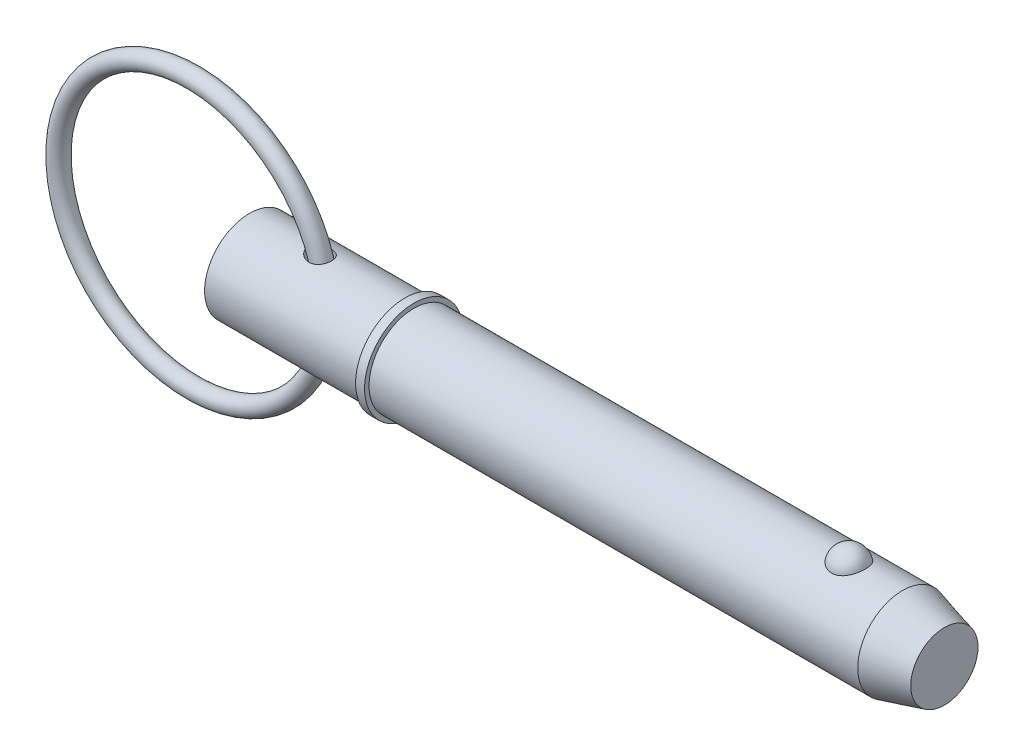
ISO-10303-21;
HEADER;
FILE_DESCRIPTION(('STEP AP214'),'2;1');
FILE_NAME('part.step','',(''),(''),'','','');
FILE_SCHEMA(('AUTOMOTIVE_DESIGN { 1 0 10303 214 1 1 1 1 }'));
ENDSEC;
DATA;
#1=APPLICATION_CONTEXT('core data for automotive mechanical design processes');
#2=APPLICATION_PROTOCOL_DEFINITION('international standard','automotive_design',2000,#1);
#3=PRODUCT_CONTEXT('',#1,'mechanical');
#4=PRODUCT('Part','Part','',(#3));
#5=PRODUCT_RELATED_PRODUCT_CATEGORY('part','',(#4));
#6=PRODUCT_DEFINITION_FORMATION('','',#4);
#7=PRODUCT_DEFINITION_CONTEXT('part definition',#1,'design');
#8=PRODUCT_DEFINITION('design','',#6,#7);
#9=PRODUCT_DEFINITION_SHAPE('','',#8);
#10=(LENGTH_UNIT() NAMED_UNIT(*) SI_UNIT(.MILLI.,.METRE.));
#11=(NAMED_UNIT(*) PLANE_ANGLE_UNIT() SI_UNIT($,.RADIAN.));
#12=(NAMED_UNIT(*) SI_UNIT($,.STERADIAN.) SOLID_ANGLE_UNIT());
#13=UNCERTAINTY_MEASURE_WITH_UNIT(LENGTH_MEASURE(1.E-05),#10,'distance_accuracy_value','');
#14=(GEOMETRIC_REPRESENTATION_CONTEXT(3) GLOBAL_UNCERTAINTY_ASSIGNED_CONTEXT((#13)) GLOBAL_UNIT_ASSIGNED_CONTEXT((#10,
#11,#12)) REPRESENTATION_CONTEXT('',''));
#15=CARTESIAN_POINT('',(0.,0.,0.));
#16=DIRECTION('',(0.,0.,1.));
#17=DIRECTION('',(1.,0.,0.));
#18=AXIS2_PLACEMENT_3D('',#15,#16,#17);
#19=CARTESIAN_POINT('',(-11.9894358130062,0.,0.));
#20=DIRECTION('',(0.,0.,1.));
#21=DIRECTION('',(1.,0.,0.));
#22=AXIS2_PLACEMENT_3D('',#19,#20,#21);
#23=TOROIDAL_SURFACE('',#22,28.575,1.905);
#24=CARTESIAN_POINT('',(18.4905641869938,0.,0.));
#25=VERTEX_POINT('',#24);
#26=VERTEX_LOOP('',#25);
#27=FACE_BOUND('',#26,.T.);
#28=ADVANCED_FACE('P0_F12',(#27),#23,.T.);
#29=CLOSED_SHELL('',(#28));
#30=MANIFOLD_SOLID_BREP('P0_B1',#29);
#31=CARTESIAN_POINT('',(0.,0.,0.));
#32=DIRECTION('',(1.,0.,0.));
#33=DIRECTION('',(0.,0.,-1.));
#34=AXIS2_PLACEMENT_3D('',#31,#32,#33);
#35=CYLINDRICAL_SURFACE('',#34,9.525);
#36=CARTESIAN_POINT('',(12.9513882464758,9.41921920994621,-1.41559473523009));
#37=CARTESIAN_POINT('',(13.0504692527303,9.40163924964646,-1.53256769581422));
#38=CARTESIAN_POINT('',(13.1602600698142,9.38319823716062,-1.64044593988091));
#39=CARTESIAN_POINT('',(13.3966485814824,9.34687220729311,-1.83618480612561));
#40=CARTESIAN_POINT('',(13.5232761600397,9.32898824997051,-1.92400906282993));
#41=CARTESIAN_POINT('',(13.78900694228,9.29593183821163,-2.07784697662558));
#42=CARTESIAN_POINT('',(13.9280753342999,9.28075215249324,-2.14391921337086));
#43=CARTESIAN_POINT('',(14.2153444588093,9.25488828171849,-2.25295850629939));
#44=CARTESIAN_POINT('',(14.3635415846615,9.24420233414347,-2.295934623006));
#45=CARTESIAN_POINT('',(14.669669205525,9.22859713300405,-2.3579005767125));
#46=CARTESIAN_POINT('',(14.8277567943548,9.22385123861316,-2.37617053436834));
#47=CARTESIAN_POINT('',(15.1447573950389,9.22170813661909,-2.38448481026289));
#48=CARTESIAN_POINT('',(15.3036699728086,9.22430739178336,-2.3745427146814));
#49=CARTESIAN_POINT('',(15.6046561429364,9.2363636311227,-2.32717331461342));
#50=CARTESIAN_POINT('',(15.7470893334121,9.24528216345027,-2.29190131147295));
#51=CARTESIAN_POINT('',(16.0228763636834,9.26842607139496,-2.19642882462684));
#52=CARTESIAN_POINT('',(16.1562346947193,9.28264879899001,-2.1362407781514));
#53=CARTESIAN_POINT('',(16.3991522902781,9.31332263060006,-1.99805318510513));
#54=CARTESIAN_POINT('',(16.5097585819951,9.32951023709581,-1.92182839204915));
#55=CARTESIAN_POINT('',(16.7159974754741,9.36298467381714,-1.75147176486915));
#56=CARTESIAN_POINT('',(16.811631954,9.38027136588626,-1.65734217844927));
#57=CARTESIAN_POINT('',(16.9833240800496,9.41356881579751,-1.45618916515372));
#58=CARTESIAN_POINT('',(17.0597719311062,9.42959946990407,-1.34950141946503));
#59=CARTESIAN_POINT('',(17.1939538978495,9.45905380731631,-1.1246201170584));
#60=CARTESIAN_POINT('',(17.2516877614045,9.4724774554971,-1.00642640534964));
#61=CARTESIAN_POINT('',(17.3474400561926,9.49535683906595,-0.760990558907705));
#62=CARTESIAN_POINT('',(17.3853184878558,9.50478431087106,-0.633691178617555));
#63=CARTESIAN_POINT('',(17.4399027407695,9.51852575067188,-0.374363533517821));
#64=CARTESIAN_POINT('',(17.4566077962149,9.52283953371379,-0.242335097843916));
#65=CARTESIAN_POINT('',(17.4685150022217,9.52590431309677,0.0235692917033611));
#66=CARTESIAN_POINT('',(17.4635842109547,9.52462091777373,0.157451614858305));
#67=CARTESIAN_POINT('',(17.4320243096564,9.5165501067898,0.422467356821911));
#68=CARTESIAN_POINT('',(17.4053947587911,9.50976257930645,0.553600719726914));
#69=CARTESIAN_POINT('',(17.3310009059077,9.49140797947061,0.809490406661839));
#70=CARTESIAN_POINT('',(17.2832204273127,9.47983724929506,0.93424176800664));
#71=CARTESIAN_POINT('',(17.1676219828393,9.45318034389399,1.1736825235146));
#72=CARTESIAN_POINT('',(17.0998044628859,9.43809424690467,1.28837214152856));
#73=CARTESIAN_POINT('',(16.9461013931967,9.40614962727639,1.50393386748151));
#74=CARTESIAN_POINT('',(16.8602910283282,9.38929862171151,1.6048606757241));
#75=CARTESIAN_POINT('',(16.6726759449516,9.35566510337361,1.79055313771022));
#76=CARTESIAN_POINT('',(16.5708731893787,9.33888258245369,1.87532077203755));
#77=CARTESIAN_POINT('',(16.3550631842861,9.30741331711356,2.02572386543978));
#78=CARTESIAN_POINT('',(16.2411701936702,9.29270956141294,2.09151983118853));
#79=CARTESIAN_POINT('',(16.0037488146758,9.26681293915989,2.20343355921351));
#80=CARTESIAN_POINT('',(15.8802207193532,9.25561996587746,2.24955191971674));
#81=CARTESIAN_POINT('',(15.6262451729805,9.23779438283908,2.32167613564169));
#82=CARTESIAN_POINT('',(15.4957570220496,9.23119272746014,2.34754561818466));
#83=CARTESIAN_POINT('',(15.2322153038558,9.22318493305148,2.37881082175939));
#84=CARTESIAN_POINT('',(15.0991611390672,9.22178001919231,2.3842017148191));
#85=CARTESIAN_POINT('',(14.8267609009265,9.22414647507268,2.37503099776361));
#86=CARTESIAN_POINT('',(14.6874545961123,9.22819578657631,2.35939810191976));
#87=CARTESIAN_POINT('',(14.412976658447,9.24129253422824,2.30756034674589));
#88=CARTESIAN_POINT('',(14.2778066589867,9.25034191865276,2.27134746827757));
#89=CARTESIAN_POINT('',(14.0027915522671,9.27334688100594,2.17561454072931));
#90=CARTESIAN_POINT('',(13.8635960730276,9.28766658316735,2.11431132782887));
#91=CARTESIAN_POINT('',(13.5969045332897,9.31925368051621,1.97041856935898));
#92=CARTESIAN_POINT('',(13.4694182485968,9.33652350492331,1.88781145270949));
#93=CARTESIAN_POINT('',(13.2243568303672,9.37286659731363,1.69844580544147));
#94=CARTESIAN_POINT('',(13.1075060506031,9.39198626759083,1.5907521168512));
#95=CARTESIAN_POINT('',(12.8957171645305,9.42881110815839,1.35544651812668));
#96=CARTESIAN_POINT('',(12.8007455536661,9.44651841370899,1.22786557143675));
#97=CARTESIAN_POINT('',(12.6580495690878,9.4741137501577,0.98872437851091));
#98=CARTESIAN_POINT('',(12.604453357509,9.4848570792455,0.880756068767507));
#99=CARTESIAN_POINT('',(12.515693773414,9.50295777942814,0.657225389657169));
#100=CARTESIAN_POINT('',(12.4805142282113,9.51031812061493,0.54166978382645));
#101=CARTESIAN_POINT('',(12.4305797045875,9.52083647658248,0.305475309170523));
#102=CARTESIAN_POINT('',(12.4159122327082,9.52397648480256,0.184816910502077));
#103=CARTESIAN_POINT('',(12.408320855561,9.52559626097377,-0.0572308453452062));
#104=CARTESIAN_POINT('',(12.4153963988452,9.52407614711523,-0.178620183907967));
#105=CARTESIAN_POINT('',(12.4495068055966,9.51684301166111,-0.409566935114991));
#106=CARTESIAN_POINT('',(12.4750931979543,9.51143444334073,-0.519353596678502));
#107=CARTESIAN_POINT('',(12.543120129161,9.49733710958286,-0.733285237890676));
#108=CARTESIAN_POINT('',(12.5855568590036,9.4886490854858,-0.837431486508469));
#109=CARTESIAN_POINT('',(12.6780792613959,9.47023833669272,-1.02356028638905));
#110=CARTESIAN_POINT('',(12.7261842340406,9.46084463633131,-1.10657511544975));
#111=CARTESIAN_POINT('',(12.8319313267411,9.44081892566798,-1.26610577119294));
#112=CARTESIAN_POINT('',(12.8895756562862,9.43018662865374,-1.34262008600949));
#113=CARTESIAN_POINT('',(12.9513882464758,9.41921920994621,-1.41559473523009));
#114=B_SPLINE_CURVE_WITH_KNOTS('',3,(#36,#37,#38,#39,#40,#41,#42,#43,#44,#45,#46,#47,#48,#49,
#50,#51,#52,#53,#54,#55,#56,#57,#58,#59,#60,#61,#62,#63,#64,#65,#66,#67,#68,#69,#70,#71,#72,#73,
#74,#75,#76,#77,#78,#79,#80,#81,#82,#83,#84,#85,#86,#87,#88,#89,#90,#91,#92,#93,#94,#95,#96,#97,
#98,#99,#100,#101,#102,#103,#104,#105,#106,#107,#108,#109,#110,#111,#112,#113),.UNSPECIFIED.,
.T.,.F.,(4,2,2,2,2,2,2,2,2,2,2,2,2,2,2,2,2,2,2,2,2,2,2,2,2,2,2,2,2,2,2,2,2,2,2,2,2,2,4),(0.,
0.462524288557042,0.925880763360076,1.3879789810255,1.84989578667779,2.32500103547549,
2.79987752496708,3.23851602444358,3.67693583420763,4.08084875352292,4.48471100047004,
4.87953549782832,5.27436531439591,5.67194282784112,6.0695347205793,6.46957303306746,
6.86961947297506,7.26997240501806,7.67031642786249,8.06901977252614,8.46767421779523,
8.86284969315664,9.25801315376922,9.65581560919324,10.0537118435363,10.4726706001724,
10.8917927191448,11.3481090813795,11.8048030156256,12.2824769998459,12.7594145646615,
13.1209614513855,13.4821903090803,13.8449555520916,14.2077115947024,14.5447865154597,
14.881785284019,15.170268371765,15.4588183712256),.UNSPECIFIED.);
#115=CARTESIAN_POINT('',(12.9513882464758,9.41921920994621,-1.41559473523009));
#116=VERTEX_POINT('',#115);
#117=EDGE_CURVE('P1_E42',#116,#116,#114,.T.);
#118=ORIENTED_EDGE('',*,*,#117,.T.);
#119=EDGE_LOOP('',(#118));
#120=FACE_BOUND('',#119,.T.);
#121=CARTESIAN_POINT('',(0.,0.,0.));
#122=DIRECTION('',(1.,0.,0.));
#123=DIRECTION('',(0.,0.,-1.));
#124=AXIS2_PLACEMENT_3D('',#121,#122,#123);
#125=CIRCLE('',#124,9.525);
#126=CARTESIAN_POINT('',(0.,0.,-9.525));
#127=VERTEX_POINT('',#126);
#128=EDGE_CURVE('P1_E9',#127,#127,#125,.T.);
#129=ORIENTED_EDGE('',*,*,#128,.T.);
#130=EDGE_LOOP('',(#129));
#131=FACE_BOUND('',#130,.T.);
#132=CARTESIAN_POINT('',(33.025,0.,0.));
#133=DIRECTION('',(1.,0.,0.));
#134=DIRECTION('',(0.,0.,-1.));
#135=AXIS2_PLACEMENT_3D('',#132,#133,#134);
#136=CIRCLE('',#135,9.525);
#137=CARTESIAN_POINT('',(33.025,0.,-9.525));
#138=VERTEX_POINT('',#137);
#139=EDGE_CURVE('P1_E25',#138,#138,#136,.T.);
#140=ORIENTED_EDGE('',*,*,#139,.F.);
#141=EDGE_LOOP('',(#140));
#142=FACE_BOUND('',#141,.T.);
#143=CARTESIAN_POINT('',(12.9513882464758,-9.41921920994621,-1.41559473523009));
#144=CARTESIAN_POINT('',(12.8706569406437,-9.43354320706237,-1.32028288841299));
#145=CARTESIAN_POINT('',(12.7970077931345,-9.44729974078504,-1.21890449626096));
#146=CARTESIAN_POINT('',(12.6667099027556,-9.47239055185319,-1.00546491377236));
#147=CARTESIAN_POINT('',(12.6100480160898,-9.48372669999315,-0.893412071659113));
#148=CARTESIAN_POINT('',(12.5163428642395,-9.50281544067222,-0.660202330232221));
#149=CARTESIAN_POINT('',(12.4794216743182,-9.51054569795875,-0.538993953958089));
#150=CARTESIAN_POINT('',(12.4282252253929,-9.52133525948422,-0.29167282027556));
#151=CARTESIAN_POINT('',(12.4139371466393,-9.52439720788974,-0.165562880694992));
#152=CARTESIAN_POINT('',(12.4092595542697,-9.52539668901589,0.0763263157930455));
#153=CARTESIAN_POINT('',(12.4169377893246,-9.5237485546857,0.192070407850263));
#154=CARTESIAN_POINT('',(12.4515961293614,-9.51640070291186,0.420478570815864));
#155=CARTESIAN_POINT('',(12.4785770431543,-9.51070081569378,0.533142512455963));
#156=CARTESIAN_POINT('',(12.5496371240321,-9.49599978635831,0.750537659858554));
#157=CARTESIAN_POINT('',(12.5934215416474,-9.48705569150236,0.855370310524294));
#158=CARTESIAN_POINT('',(12.6960201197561,-9.46670226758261,1.05710432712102));
#159=CARTESIAN_POINT('',(12.754838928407,-9.45529217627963,1.15400322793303));
#160=CARTESIAN_POINT('',(12.8926588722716,-9.42958102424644,1.34883014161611));
#161=CARTESIAN_POINT('',(12.9731843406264,-9.41509922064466,1.44565277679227));
#162=CARTESIAN_POINT('',(13.1473692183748,-9.38554264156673,1.62653953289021));
#163=CARTESIAN_POINT('',(13.2410364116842,-9.37046751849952,1.71059603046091));
#164=CARTESIAN_POINT('',(13.454392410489,-9.33867330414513,1.87697964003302));
#165=CARTESIAN_POINT('',(13.5758667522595,-9.32205896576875,1.95704323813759));
#166=CARTESIAN_POINT('',(13.8299208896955,-9.29140277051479,2.09777392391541));
#167=CARTESIAN_POINT('',(13.9625074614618,-9.27736250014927,2.15842906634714));
#168=CARTESIAN_POINT('',(14.2477938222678,-9.25234849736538,2.26337318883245));
#169=CARTESIAN_POINT('',(14.4012368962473,-9.2417532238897,2.30575283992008));
#170=CARTESIAN_POINT('',(14.7134258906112,-9.22706044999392,2.36387471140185));
#171=CARTESIAN_POINT('',(14.8721705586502,-9.22296142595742,2.37962317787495));
#172=CARTESIAN_POINT('',(15.1841930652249,-9.22219798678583,2.3825815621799));
#173=CARTESIAN_POINT('',(15.3374581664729,-9.22526675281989,2.37081567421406));
#174=CARTESIAN_POINT('',(15.6390558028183,-9.23821642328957,2.31984408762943));
#175=CARTESIAN_POINT('',(15.7873916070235,-9.24809271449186,2.28065697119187));
#176=CARTESIAN_POINT('',(16.0605055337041,-9.27231045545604,2.17997072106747));
#177=CARTESIAN_POINT('',(16.1861988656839,-9.28616347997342,2.12082794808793));
#178=CARTESIAN_POINT('',(16.4248737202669,-9.31689725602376,1.98144352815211));
#179=CARTESIAN_POINT('',(16.5378583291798,-9.33377726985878,1.90120701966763));
#180=CARTESIAN_POINT('',(16.7424913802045,-9.36766057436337,1.72629138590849));
#181=CARTESIAN_POINT('',(16.8349077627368,-9.38461836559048,1.63249912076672));
#182=CARTESIAN_POINT('',(17.0025959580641,-9.41752009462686,1.43052052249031));
#183=CARTESIAN_POINT('',(17.0778684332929,-9.43346407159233,1.32233474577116));
#184=CARTESIAN_POINT('',(17.2093311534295,-9.46256896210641,1.09477833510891));
#185=CARTESIAN_POINT('',(17.2655443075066,-9.47573320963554,0.975421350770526));
#186=CARTESIAN_POINT('',(17.3577240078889,-9.49788660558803,0.72876499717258));
#187=CARTESIAN_POINT('',(17.3936897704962,-9.5068755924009,0.601465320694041));
#188=CARTESIAN_POINT('',(17.4447894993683,-9.51977728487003,0.341392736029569));
#189=CARTESIAN_POINT('',(17.4597470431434,-9.52364698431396,0.208583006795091));
#190=CARTESIAN_POINT('',(17.467935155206,-9.52575588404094,-0.0577507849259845));
#191=CARTESIAN_POINT('',(17.4611651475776,-9.52399493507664,-0.191274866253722));
#192=CARTESIAN_POINT('',(17.4259933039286,-9.51501704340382,-0.455658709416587));
#193=CARTESIAN_POINT('',(17.3975278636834,-9.50778405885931,-0.586509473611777));
#194=CARTESIAN_POINT('',(17.3195245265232,-9.48862442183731,-0.841413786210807));
#195=CARTESIAN_POINT('',(17.2699864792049,-9.47669773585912,-0.965467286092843));
#196=CARTESIAN_POINT('',(17.1510794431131,-9.44947793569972,-1.20302860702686));
#197=CARTESIAN_POINT('',(17.0817421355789,-9.43419020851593,-1.31655289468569));
#198=CARTESIAN_POINT('',(16.9249035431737,-9.40193593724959,-1.52999797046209));
#199=CARTESIAN_POINT('',(16.8374037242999,-9.38496952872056,-1.62991985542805));
#200=CARTESIAN_POINT('',(16.6472525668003,-9.35139745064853,-1.81261591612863));
#201=CARTESIAN_POINT('',(16.544718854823,-9.33479003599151,-1.89551219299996));
#202=CARTESIAN_POINT('',(16.3268885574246,-9.30366076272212,-2.04284430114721));
#203=CARTESIAN_POINT('',(16.2115933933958,-9.28913867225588,-2.10728218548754));
#204=CARTESIAN_POINT('',(15.9721327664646,-9.26380878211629,-2.21598517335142));
#205=CARTESIAN_POINT('',(15.8480095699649,-9.25298455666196,-2.26033977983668));
#206=CARTESIAN_POINT('',(15.5939970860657,-9.23601616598,-2.32870721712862));
#207=CARTESIAN_POINT('',(15.4641070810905,-9.22987258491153,-2.35271750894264));
#208=CARTESIAN_POINT('',(15.1982340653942,-9.22261892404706,-2.38099747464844));
#209=CARTESIAN_POINT('',(15.0621840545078,-9.22166165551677,-2.38466791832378));
#210=CARTESIAN_POINT('',(14.7911713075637,-9.22504733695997,-2.37153091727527));
#211=CARTESIAN_POINT('',(14.6562088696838,-9.22939169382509,-2.35471803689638));
#212=CARTESIAN_POINT('',(14.3799999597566,-9.24325361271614,-2.29972931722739));
#213=CARTESIAN_POINT('',(14.2390842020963,-9.25314817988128,-2.25998976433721));
#214=CARTESIAN_POINT('',(13.9651910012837,-9.2770918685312,-2.15959208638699));
#215=CARTESIAN_POINT('',(13.8322212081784,-9.29114491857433,-2.09891417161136));
#216=CARTESIAN_POINT('',(13.5621642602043,-9.32369066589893,-1.94960068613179));
#217=CARTESIAN_POINT('',(13.4264724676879,-9.34251276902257,-1.85849626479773));
#218=CARTESIAN_POINT('',(13.1736579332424,-9.38095091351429,-1.6535412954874));
#219=CARTESIAN_POINT('',(13.0565182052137,-9.40056620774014,-1.53971177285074));
#220=CARTESIAN_POINT('',(12.9513882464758,-9.41921920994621,-1.41559473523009));
#221=B_SPLINE_CURVE_WITH_KNOTS('',3,(#143,#144,#145,#146,#147,#148,#149,#150,#151,#152,#153,
#154,#155,#156,#157,#158,#159,#160,#161,#162,#163,#164,#165,#166,#167,#168,#169,#170,#171,#172,
#173,#174,#175,#176,#177,#178,#179,#180,#181,#182,#183,#184,#185,#186,#187,#188,#189,#190,#191,
#192,#193,#194,#195,#196,#197,#198,#199,#200,#201,#202,#203,#204,#205,#206,#207,#208,#209,#210,
#211,#212,#213,#214,#215,#216,#217,#218,#219,#220),.UNSPECIFIED.,.T.,.F.,(4,2,2,2,2,2,2,2,2,2,2,
2,2,2,2,2,2,2,2,2,2,2,2,2,2,2,2,2,2,2,2,2,2,2,2,2,2,2,4),(0.,0.37674646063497,0.753200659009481,
1.13195666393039,1.51049805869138,1.85679105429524,2.20309856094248,2.54359033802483,
2.88418751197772,3.26301611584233,3.64207005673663,4.07954912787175,4.51729693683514,
4.99355673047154,5.46970480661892,5.92841231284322,6.38680927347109,6.80346940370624,
7.2200281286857,7.61642768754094,8.01281192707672,8.4087180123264,8.8046394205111,
9.20386620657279,9.60310357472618,10.0035159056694,10.4039310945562,10.8037091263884,
11.2034549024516,11.6002252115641,11.9969513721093,12.3918916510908,12.7868812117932,
13.1934480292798,13.6001227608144,14.038511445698,14.4773156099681,14.9683748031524,
15.4589817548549),.UNSPECIFIED.);
#222=CARTESIAN_POINT('',(12.9513882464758,-9.41921920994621,-1.41559473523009));
#223=VERTEX_POINT('',#222);
#224=EDGE_CURVE('P1_E17',#223,#223,#221,.T.);
#225=ORIENTED_EDGE('',*,*,#224,.T.);
#226=EDGE_LOOP('',(#225));
#227=FACE_BOUND('',#226,.T.);
#228=ADVANCED_FACE('P1_F13',(#120,#131,#142,#227),#35,.T.);
#229=CARTESIAN_POINT('',(0.,0.,0.));
#230=DIRECTION('',(1.,0.,0.));
#231=DIRECTION('',(0.,0.,-1.));
#232=AXIS2_PLACEMENT_3D('',#229,#230,#231);
#233=CYLINDRICAL_SURFACE('',#232,9.525);
#234=CARTESIAN_POINT('',(138.743054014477,0.,0.));
#235=DIRECTION('',(1.,0.,0.));
#236=DIRECTION('',(0.,0.,-1.));
#237=AXIS2_PLACEMENT_3D('',#234,#235,#236);
#238=CIRCLE('',#237,9.525);
#239=CARTESIAN_POINT('',(138.743054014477,0.,-9.525));
#240=VERTEX_POINT('',#239);
#241=EDGE_CURVE('P1_E99',#240,#240,#238,.T.);
#242=ORIENTED_EDGE('',*,*,#241,.F.);
#243=EDGE_LOOP('',(#242));
#244=FACE_BOUND('',#243,.T.);
#245=CARTESIAN_POINT('',(34.93,0.,0.));
#246=DIRECTION('',(1.,0.,0.));
#247=DIRECTION('',(0.,0.,-1.));
#248=AXIS2_PLACEMENT_3D('',#245,#246,#247);
#249=CIRCLE('',#248,9.525);
#250=CARTESIAN_POINT('',(34.93,0.,-9.525));
#251=VERTEX_POINT('',#250);
#252=EDGE_CURVE('P1_E96',#251,#251,#249,.T.);
#253=ORIENTED_EDGE('',*,*,#252,.T.);
#254=EDGE_LOOP('',(#253));
#255=FACE_BOUND('',#254,.T.);
#256=CARTESIAN_POINT('',(127.345757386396,8.80405803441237,3.63513233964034));
#257=CARTESIAN_POINT('',(127.251676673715,8.80405953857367,3.63513053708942));
#258=CARTESIAN_POINT('',(127.157561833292,8.80561325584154,3.63137461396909));
#259=CARTESIAN_POINT('',(126.970012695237,8.81177748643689,3.61638665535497));
#260=CARTESIAN_POINT('',(126.876578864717,8.81638992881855,3.60514990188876));
#261=CARTESIAN_POINT('',(126.597945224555,8.8346711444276,3.56024627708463));
#262=CARTESIAN_POINT('',(126.414691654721,8.85278327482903,3.51538626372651));
#263=CARTESIAN_POINT('',(126.059509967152,8.89871214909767,3.39742145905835));
#264=CARTESIAN_POINT('',(125.887553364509,8.92650327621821,3.32439116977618));
#265=CARTESIAN_POINT('',(125.558707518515,8.98874819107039,3.15220244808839));
#266=CARTESIAN_POINT('',(125.401811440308,9.02319893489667,3.05305594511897));
#267=CARTESIAN_POINT('',(125.102214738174,9.09629186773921,2.82797815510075));
#268=CARTESIAN_POINT('',(124.960060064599,9.13502685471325,2.70135138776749));
#269=CARTESIAN_POINT('',(124.698299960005,9.2118657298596,2.42641932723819));
#270=CARTESIAN_POINT('',(124.578701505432,9.24996941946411,2.27810735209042));
#271=CARTESIAN_POINT('',(124.359645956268,9.32341082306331,1.95652290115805));
#272=CARTESIAN_POINT('',(124.261317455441,9.35855090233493,1.78243511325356));
#273=CARTESIAN_POINT('',(124.093819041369,9.42045142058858,1.41937246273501));
#274=CARTESIAN_POINT('',(124.024651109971,9.44721128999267,1.23039658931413));
#275=CARTESIAN_POINT('',(123.916199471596,9.48990641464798,0.840370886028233));
#276=CARTESIAN_POINT('',(123.877288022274,9.50570658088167,0.639202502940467));
#277=CARTESIAN_POINT('',(123.831555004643,9.52433146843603,0.232664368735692));
#278=CARTESIAN_POINT('',(123.824732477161,9.52715657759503,0.0272947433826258));
#279=CARTESIAN_POINT('',(123.843255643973,9.51956918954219,-0.380478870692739));
#280=CARTESIAN_POINT('',(123.868405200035,9.50923740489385,-0.582893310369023));
#281=CARTESIAN_POINT('',(123.95002537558,9.47651897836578,-0.980293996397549));
#282=CARTESIAN_POINT('',(124.006496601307,9.45413210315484,-1.17528009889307));
#283=CARTESIAN_POINT('',(124.149719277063,9.39954044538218,-1.55263697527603));
#284=CARTESIAN_POINT('',(124.236512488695,9.36732213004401,-1.73498993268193));
#285=CARTESIAN_POINT('',(124.438610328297,9.29640700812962,-2.08177763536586));
#286=CARTESIAN_POINT('',(124.553917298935,9.25770966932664,-2.24621090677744));
#287=CARTESIAN_POINT('',(124.811264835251,9.17775604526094,-2.5533833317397));
#288=CARTESIAN_POINT('',(124.953434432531,9.136488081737,-2.696011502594));
#289=CARTESIAN_POINT('',(125.26089985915,9.05620497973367,-2.95451229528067));
#290=CARTESIAN_POINT('',(125.426193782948,9.01718965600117,-3.07038711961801));
#291=CARTESIAN_POINT('',(125.772052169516,8.94680019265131,-3.26976836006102));
#292=CARTESIAN_POINT('',(125.952227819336,8.91528408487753,-3.353897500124));
#293=CARTESIAN_POINT('',(126.325651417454,8.86272514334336,-3.49043503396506));
#294=CARTESIAN_POINT('',(126.518894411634,8.84167836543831,-3.54285537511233));
#295=CARTESIAN_POINT('',(126.902503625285,8.81348056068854,-3.61241306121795));
#296=CARTESIAN_POINT('',(127.092525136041,8.80568348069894,-3.63119339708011));
#297=CARTESIAN_POINT('',(127.473190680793,8.80289410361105,-3.63795342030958));
#298=CARTESIAN_POINT('',(127.663834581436,8.80789922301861,-3.62593932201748));
#299=CARTESIAN_POINT('',(128.034007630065,8.82974915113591,-3.57238430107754));
#300=CARTESIAN_POINT('',(128.213697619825,8.84621463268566,-3.53178890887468));
#301=CARTESIAN_POINT('',(128.563422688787,8.88875330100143,-3.42331083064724));
#302=CARTESIAN_POINT('',(128.733456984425,8.91482726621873,-3.35542593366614));
#303=CARTESIAN_POINT('',(129.063237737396,8.97448239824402,-3.19248225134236));
#304=CARTESIAN_POINT('',(129.222680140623,9.00821446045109,-3.09686474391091));
#305=CARTESIAN_POINT('',(129.523513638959,9.07935398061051,-2.88162736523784));
#306=CARTESIAN_POINT('',(129.664900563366,9.11676228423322,-2.76200196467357));
#307=CARTESIAN_POINT('',(129.93331931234,9.19347419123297,-2.49516285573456));
#308=CARTESIAN_POINT('',(130.059275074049,9.23277872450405,-2.34686614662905));
#309=CARTESIAN_POINT('',(130.285522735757,9.3073761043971,-2.03093683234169));
#310=CARTESIAN_POINT('',(130.38581004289,9.34266823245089,-1.86330077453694));
#311=CARTESIAN_POINT('',(130.561514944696,9.40674710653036,-1.50744893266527));
#312=CARTESIAN_POINT('',(130.636041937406,9.43529176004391,-1.31874876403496));
#313=CARTESIAN_POINT('',(130.75416505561,9.48144132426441,-0.930631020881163));
#314=CARTESIAN_POINT('',(130.797760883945,9.49904612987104,-0.73121334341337));
#315=CARTESIAN_POINT('',(130.853158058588,9.5215314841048,-0.327147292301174));
#316=CARTESIAN_POINT('',(130.864935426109,9.52640243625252,-0.122495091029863));
#317=CARTESIAN_POINT('',(130.856382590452,9.5228957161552,0.286018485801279));
#318=CARTESIAN_POINT('',(130.83605305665,9.5145183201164,0.489879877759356));
#319=CARTESIAN_POINT('',(130.763884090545,9.48544083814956,0.889994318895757));
#320=CARTESIAN_POINT('',(130.712199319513,9.46480124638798,1.08627971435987));
#321=CARTESIAN_POINT('',(130.578491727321,9.4133389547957,1.46682086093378));
#322=CARTESIAN_POINT('',(130.496466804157,9.38251554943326,1.65107577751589));
#323=CARTESIAN_POINT('',(130.30319292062,9.31365636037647,2.00346348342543));
#324=CARTESIAN_POINT('',(130.191783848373,9.27558138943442,2.17150083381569));
#325=CARTESIAN_POINT('',(129.942294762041,9.19638714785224,2.4856311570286));
#326=CARTESIAN_POINT('',(129.804216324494,9.15526805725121,2.63172542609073));
#327=CARTESIAN_POINT('',(129.504843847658,9.07465393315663,2.89750997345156));
#328=CARTESIAN_POINT('',(129.343610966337,9.03515496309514,3.01726776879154));
#329=CARTESIAN_POINT('',(129.001613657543,8.96227564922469,3.22732920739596));
#330=CARTESIAN_POINT('',(128.820841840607,8.92889763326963,3.31762165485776));
#331=CARTESIAN_POINT('',(128.451445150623,8.8734538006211,3.46314419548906));
#332=CARTESIAN_POINT('',(128.26332371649,8.85102983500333,3.51950082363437));
#333=CARTESIAN_POINT('',(127.97578699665,8.8266696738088,3.57993683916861));
#334=CARTESIAN_POINT('',(127.879133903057,8.82009725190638,3.5960621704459));
#335=CARTESIAN_POINT('',(127.684677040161,8.81020897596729,3.62022512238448));
#336=CARTESIAN_POINT('',(127.58687410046,8.80689090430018,3.62826825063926));
#337=CARTESIAN_POINT('',(127.441224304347,8.80445615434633,3.63416760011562));
#338=CARTESIAN_POINT('',(127.393495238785,8.80405727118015,3.63513325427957));
#339=CARTESIAN_POINT('',(127.345757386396,8.80405803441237,3.63513233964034));
#340=B_SPLINE_CURVE_WITH_KNOTS('',3,(#256,#257,#258,#259,#260,#261,#262,#263,#264,#265,#266,
#267,#268,#269,#270,#271,#272,#273,#274,#275,#276,#277,#278,#279,#280,#281,#282,#283,#284,#285,
#286,#287,#288,#289,#290,#291,#292,#293,#294,#295,#296,#297,#298,#299,#300,#301,#302,#303,#304,
#305,#306,#307,#308,#309,#310,#311,#312,#313,#314,#315,#316,#317,#318,#319,#320,#321,#322,#323,
#324,#325,#326,#327,#328,#329,#330,#331,#332,#333,#334,#335,#336,#337,#338,#339),.UNSPECIFIED.,
.T.,.F.,(4,2,2,2,2,2,2,2,2,2,2,2,2,2,2,2,2,2,2,2,2,2,2,2,2,2,2,2,2,2,2,2,2,2,2,2,2,2,2,2,2,4),
(0.,0.282202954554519,0.564584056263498,1.13017050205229,1.69427128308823,2.25811483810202,
2.83836627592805,3.41879688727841,4.02497117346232,4.63118665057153,5.24474754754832,
5.85829010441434,6.46808687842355,7.07789545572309,7.68854723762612,8.29924920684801,
8.91296283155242,9.52662591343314,10.1275338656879,10.7282152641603,11.2986646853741,
11.868998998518,12.4213015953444,12.973648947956,13.5380053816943,14.1024919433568,
14.695298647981,15.2882113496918,15.8999469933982,16.5116885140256,17.1238909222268,
17.7360805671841,18.3452748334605,18.9545113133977,19.567138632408,20.179729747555,
20.7907316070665,21.4019653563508,21.9915938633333,22.2859053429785,22.5800161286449,
22.7232098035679),.UNSPECIFIED.);
#341=CARTESIAN_POINT('',(127.345757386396,8.80405803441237,3.63513233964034));
#342=VERTEX_POINT('',#341);
#343=EDGE_CURVE('P1_E34',#342,#342,#340,.T.);
#344=ORIENTED_EDGE('',*,*,#343,.T.);
#345=EDGE_LOOP('',(#344));
#346=FACE_BOUND('',#345,.T.);
#347=ADVANCED_FACE('P1_F46',(#244,#255,#346),#233,.T.);
#348=CARTESIAN_POINT('',(0.,0.,0.));
#349=DIRECTION('',(-1.,0.,0.));
#350=DIRECTION('',(0.,0.,1.));
#351=AXIS2_PLACEMENT_3D('',#348,#349,#350);
#352=PLANE('',#351);
#353=ORIENTED_EDGE('',*,*,#128,.F.);
#354=EDGE_LOOP('',(#353));
#355=FACE_BOUND('',#354,.T.);
#356=ADVANCED_FACE('P1_F15',(#355),#352,.T.);
#357=CARTESIAN_POINT('',(33.025,9.525,0.));
#358=DIRECTION('',(-1.,0.,0.));
#359=DIRECTION('',(0.,0.,1.));
#360=AXIS2_PLACEMENT_3D('',#357,#358,#359);
#361=PLANE('',#360);
#362=ORIENTED_EDGE('',*,*,#139,.T.);
#363=EDGE_LOOP('',(#362));
#364=FACE_BOUND('',#363,.T.);
#365=CARTESIAN_POINT('',(33.025,0.,0.));
#366=DIRECTION('',(1.,0.,0.));
#367=DIRECTION('',(0.,0.,-1.));
#368=AXIS2_PLACEMENT_3D('',#365,#366,#367);
#369=CIRCLE('',#368,10.4775);
#370=CARTESIAN_POINT('',(33.025,0.,-10.4775));
#371=VERTEX_POINT('',#370);
#372=EDGE_CURVE('P1_E30',#371,#371,#369,.T.);
#373=ORIENTED_EDGE('',*,*,#372,.F.);
#374=EDGE_LOOP('',(#373));
#375=FACE_BOUND('',#374,.T.);
#376=ADVANCED_FACE('P1_F81',(#364,#375),#361,.T.);
#377=CARTESIAN_POINT('',(0.,0.,0.));
#378=DIRECTION('',(1.,0.,0.));
#379=DIRECTION('',(0.,0.,-1.));
#380=AXIS2_PLACEMENT_3D('',#377,#378,#379);
#381=CYLINDRICAL_SURFACE('',#380,10.4775);
#382=ORIENTED_EDGE('',*,*,#372,.T.);
#383=EDGE_LOOP('',(#382));
#384=FACE_BOUND('',#383,.T.);
#385=CARTESIAN_POINT('',(34.93,0.,0.));
#386=DIRECTION('',(1.,0.,0.));
#387=DIRECTION('',(0.,0.,-1.));
#388=AXIS2_PLACEMENT_3D('',#385,#386,#387);
#389=CIRCLE('',#388,10.4775);
#390=CARTESIAN_POINT('',(34.93,0.,-10.4775));
#391=VERTEX_POINT('',#390);
#392=EDGE_CURVE('P1_E95',#391,#391,#389,.T.);
#393=ORIENTED_EDGE('',*,*,#392,.F.);
#394=EDGE_LOOP('',(#393));
#395=FACE_BOUND('',#394,.T.);
#396=ADVANCED_FACE('P1_F68',(#384,#395),#381,.T.);
#397=CARTESIAN_POINT('',(34.93,10.4775,0.));
#398=DIRECTION('',(1.,0.,0.));
#399=DIRECTION('',(0.,0.,-1.));
#400=AXIS2_PLACEMENT_3D('',#397,#398,#399);
#401=PLANE('',#400);
#402=ORIENTED_EDGE('',*,*,#392,.T.);
#403=EDGE_LOOP('',(#402));
#404=FACE_BOUND('',#403,.T.);
#405=ORIENTED_EDGE('',*,*,#252,.F.);
#406=EDGE_LOOP('',(#405));
#407=FACE_BOUND('',#406,.T.);
#408=ADVANCED_FACE('P1_F62',(#404,#407),#401,.T.);
#409=CARTESIAN_POINT('',(147.63,0.,0.));
#410=DIRECTION('',(-1.,0.,0.));
#411=DIRECTION('',(0.,0.,1.));
#412=AXIS2_PLACEMENT_3D('',#409,#410,#411);
#413=CONICAL_SURFACE('',#412,7.14375000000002,0.261799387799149);
#414=ORIENTED_EDGE('',*,*,#241,.T.);
#415=EDGE_LOOP('',(#414));
#416=FACE_BOUND('',#415,.T.);
#417=CARTESIAN_POINT('',(147.63,0.,0.));
#418=DIRECTION('',(1.,0.,0.));
#419=DIRECTION('',(0.,0.,-1.));
#420=AXIS2_PLACEMENT_3D('',#417,#418,#419);
#421=CIRCLE('',#420,7.14375000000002);
#422=CARTESIAN_POINT('',(147.63,0.,-7.14375000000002));
#423=VERTEX_POINT('',#422);
#424=EDGE_CURVE('P1_E41',#423,#423,#421,.T.);
#425=ORIENTED_EDGE('',*,*,#424,.F.);
#426=EDGE_LOOP('',(#425));
#427=FACE_BOUND('',#426,.T.);
#428=ADVANCED_FACE('P1_F59',(#416,#427),#413,.T.);
#429=CARTESIAN_POINT('',(147.63,7.14375000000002,0.));
#430=DIRECTION('',(1.,0.,0.));
#431=DIRECTION('',(0.,0.,-1.));
#432=AXIS2_PLACEMENT_3D('',#429,#430,#431);
#433=PLANE('',#432);
#434=ORIENTED_EDGE('',*,*,#424,.T.);
#435=EDGE_LOOP('',(#434));
#436=FACE_BOUND('',#435,.T.);
#437=ADVANCED_FACE('P1_F55',(#436),#433,.T.);
#438=CARTESIAN_POINT('',(127.345757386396,8.57249999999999,0.));
#439=DIRECTION('',(-1.,0.,0.));
#440=DIRECTION('',(0.,1.,0.));
#441=AXIS2_PLACEMENT_3D('',#438,#439,#440);
#442=SPHERICAL_SURFACE('',#441,3.6425);
#443=ORIENTED_EDGE('',*,*,#343,.F.);
#444=EDGE_LOOP('',(#443));
#445=FACE_BOUND('',#444,.T.);
#446=ADVANCED_FACE('P1_F50',(#445),#442,.T.);
#447=CARTESIAN_POINT('',(-11.9894358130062,0.,0.));
#448=DIRECTION('',(0.,0.,1.));
#449=DIRECTION('',(1.,0.,0.));
#450=AXIS2_PLACEMENT_3D('',#447,#448,#449);
#451=TOROIDAL_SURFACE('',#450,28.575,2.38125);
#452=ORIENTED_EDGE('',*,*,#224,.F.);
#453=EDGE_LOOP('',(#452));
#454=FACE_BOUND('',#453,.T.);
#455=ORIENTED_EDGE('',*,*,#117,.F.);
#456=EDGE_LOOP('',(#455));
#457=FACE_BOUND('',#456,.T.);
#458=ADVANCED_FACE('P1_F54',(#454,#457),#451,.F.);
#459=CLOSED_SHELL('',(#228,#347,#356,#376,#396,#408,#428,#437,#446,#458));
#460=MANIFOLD_SOLID_BREP('P1_B1',#459);
#461=ADVANCED_BREP_SHAPE_REPRESENTATION('',(#18,#30,#460),#14);
#462=SHAPE_DEFINITION_REPRESENTATION(#9,#461);
ENDSEC;
END-ISO-10303-21;
